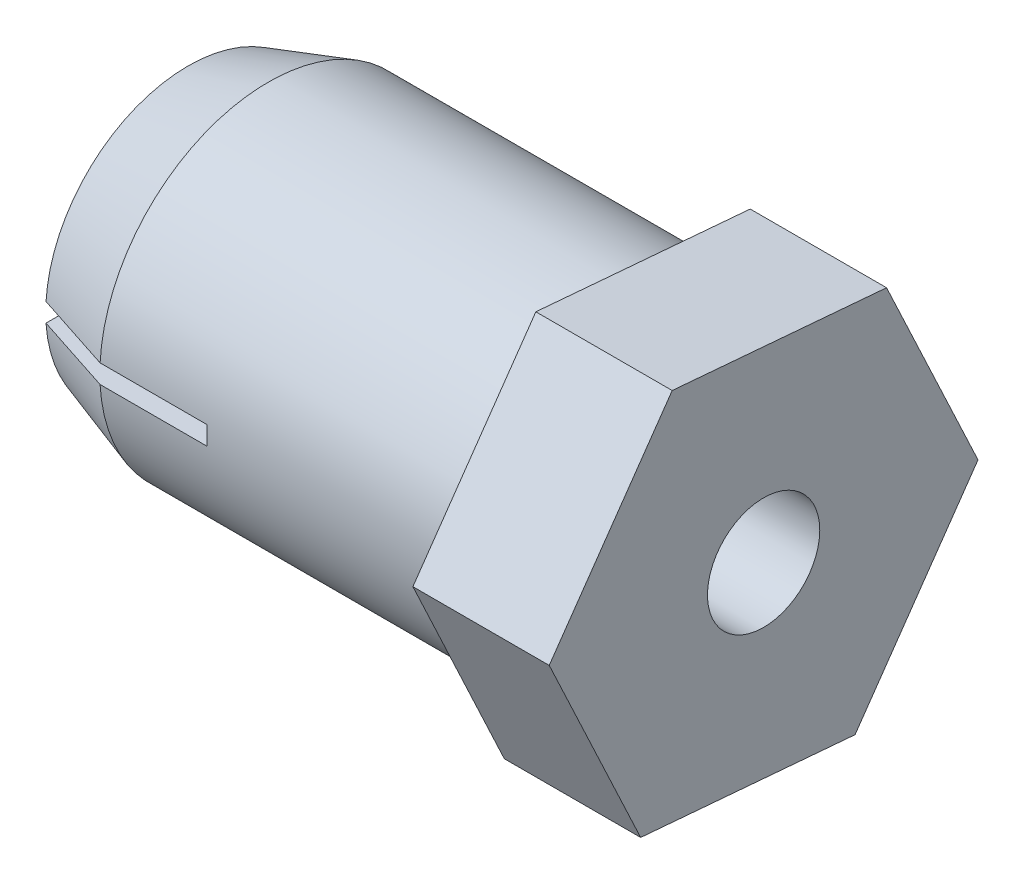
ISO-10303-21;
HEADER;
FILE_DESCRIPTION(('STEP AP214'),'2;1');
FILE_NAME('part.step','',(''),(''),'','','');
FILE_SCHEMA(('AUTOMOTIVE_DESIGN { 1 0 10303 214 1 1 1 1 }'));
ENDSEC;
DATA;
#1=APPLICATION_CONTEXT('core data for automotive mechanical design processes');
#2=APPLICATION_PROTOCOL_DEFINITION('international standard','automotive_design',2000,#1);
#3=PRODUCT_CONTEXT('',#1,'mechanical');
#4=PRODUCT('Part','Part','',(#3));
#5=PRODUCT_RELATED_PRODUCT_CATEGORY('part','',(#4));
#6=PRODUCT_DEFINITION_FORMATION('','',#4);
#7=PRODUCT_DEFINITION_CONTEXT('part definition',#1,'design');
#8=PRODUCT_DEFINITION('design','',#6,#7);
#9=PRODUCT_DEFINITION_SHAPE('','',#8);
#10=(LENGTH_UNIT() NAMED_UNIT(*) SI_UNIT(.MILLI.,.METRE.));
#11=(NAMED_UNIT(*) PLANE_ANGLE_UNIT() SI_UNIT($,.RADIAN.));
#12=(NAMED_UNIT(*) SI_UNIT($,.STERADIAN.) SOLID_ANGLE_UNIT());
#13=UNCERTAINTY_MEASURE_WITH_UNIT(LENGTH_MEASURE(1.E-05),#10,'distance_accuracy_value','');
#14=(GEOMETRIC_REPRESENTATION_CONTEXT(3) GLOBAL_UNCERTAINTY_ASSIGNED_CONTEXT((#13)) GLOBAL_UNIT_ASSIGNED_CONTEXT((#10,
#11,#12)) REPRESENTATION_CONTEXT('',''));
#15=CARTESIAN_POINT('',(0.,0.,0.));
#16=DIRECTION('',(0.,0.,1.));
#17=DIRECTION('',(1.,0.,0.));
#18=AXIS2_PLACEMENT_3D('',#15,#16,#17);
#19=CARTESIAN_POINT('',(-13.43,0.,0.));
#20=DIRECTION('',(1.,0.,0.));
#21=DIRECTION('',(0.,0.,-1.));
#22=AXIS2_PLACEMENT_3D('',#19,#20,#21);
#23=CONICAL_SURFACE('',#22,6.3,0.314231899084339);
#24=CARTESIAN_POINT('',(-23.5400334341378,0.349999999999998,-2.99384995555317));
#25=CARTESIAN_POINT('',(-22.8105636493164,0.349999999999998,-3.23250725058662));
#26=CARTESIAN_POINT('',(-22.0810028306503,0.349999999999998,-3.47088592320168));
#27=CARTESIAN_POINT('',(-20.6217571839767,0.349999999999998,-3.94726316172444));
#28=CARTESIAN_POINT('',(-19.8920723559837,0.349999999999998,-4.18526172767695));
#29=CARTESIAN_POINT('',(-18.5098872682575,0.349999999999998,-4.63587126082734));
#30=CARTESIAN_POINT('',(-17.8573936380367,0.349999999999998,-4.84850257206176));
#31=CARTESIAN_POINT('',(-16.5523685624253,0.349999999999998,-5.27364924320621));
#32=CARTESIAN_POINT('',(-15.8998371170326,0.349999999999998,-5.48616460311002));
#33=CARTESIAN_POINT('',(-13.8649457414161,0.349999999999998,-6.14875251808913));
#34=CARTESIAN_POINT('',(-12.4825423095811,0.349999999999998,-6.59869145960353));
#35=CARTESIAN_POINT('',(-9.71767094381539,0.349999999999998,-7.49837042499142));
#36=CARTESIAN_POINT('',(-8.33520300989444,0.349999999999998,-7.94811044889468));
#37=CARTESIAN_POINT('',(-6.95272634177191,0.349999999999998,-8.39782354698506));
#38=B_SPLINE_CURVE_WITH_KNOTS('',3,(#24,#25,#26,#27,#28,#29,#30,#31,#32,#33,#34,#35,#36,#37),
.UNSPECIFIED.,.F.,.F.,(4,2,2,2,2,2,4),(0.,2.30255298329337,4.60510569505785,6.66390148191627,
8.722697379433,13.0840456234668,17.4453932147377),.UNSPECIFIED.);
#39=CARTESIAN_POINT('',(-16.43,0.349999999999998,-5.31348520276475));
#40=VERTEX_POINT('',#39);
#41=CARTESIAN_POINT('',(-13.43,0.349999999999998,-6.290270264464));
#42=VERTEX_POINT('',#41);
#43=EDGE_CURVE('E204',#40,#42,#38,.T.);
#44=ORIENTED_EDGE('',*,*,#43,.F.);
#45=CARTESIAN_POINT('',(-16.43,0.,0.));
#46=DIRECTION('',(1.,0.,0.));
#47=DIRECTION('',(0.,0.,-1.));
#48=AXIS2_PLACEMENT_3D('',#45,#46,#47);
#49=CIRCLE('',#48,5.325);
#50=CARTESIAN_POINT('',(-16.43,0.349999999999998,5.31348520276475));
#51=VERTEX_POINT('',#50);
#52=EDGE_CURVE('E267',#40,#51,#49,.T.);
#53=ORIENTED_EDGE('',*,*,#52,.T.);
#54=CARTESIAN_POINT('',(-6.95272634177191,0.349999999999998,8.39782354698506));
#55=CARTESIAN_POINT('',(-8.33520317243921,0.349999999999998,7.94811032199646));
#56=CARTESIAN_POINT('',(-9.71767130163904,0.349999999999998,7.49837027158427));
#57=CARTESIAN_POINT('',(-12.4825426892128,0.349999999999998,6.59869137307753));
#58=CARTESIAN_POINT('',(-13.8649459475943,0.349999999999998,6.14875252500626));
#59=CARTESIAN_POINT('',(-15.9384669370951,0.349999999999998,5.47358617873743));
#60=CARTESIAN_POINT('',(-16.6296266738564,0.349999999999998,5.24848769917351));
#61=CARTESIAN_POINT('',(-18.0119030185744,0.349999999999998,4.7981584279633));
#62=CARTESIAN_POINT('',(-18.7030196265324,0.349999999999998,4.57292763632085));
#63=CARTESIAN_POINT('',(-20.085190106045,0.349999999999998,4.12227324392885));
#64=CARTESIAN_POINT('',(-20.7762439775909,0.349999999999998,3.89684964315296));
#65=CARTESIAN_POINT('',(-22.1582373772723,0.349999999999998,3.44565201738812));
#66=CARTESIAN_POINT('',(-22.8491769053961,0.349999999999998,3.21987799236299));
#67=CARTESIAN_POINT('',(-23.5400334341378,0.349999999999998,2.99384995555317));
#68=B_SPLINE_CURVE_WITH_KNOTS('',3,(#54,#55,#56,#57,#58,#59,#60,#61,#62,#63,#64,#65,#66,#67),
.UNSPECIFIED.,.F.,.F.,(4,2,2,2,2,2,4),(0.,4.36134817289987,8.72269583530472,10.9033700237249,
13.0840441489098,15.2647185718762,17.4453932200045),.UNSPECIFIED.);
#69=CARTESIAN_POINT('',(-13.43,0.349999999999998,6.290270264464));
#70=VERTEX_POINT('',#69);
#71=EDGE_CURVE('E185',#70,#51,#68,.T.);
#72=ORIENTED_EDGE('',*,*,#71,.F.);
#73=CARTESIAN_POINT('',(-13.43,0.,0.));
#74=DIRECTION('',(1.,0.,0.));
#75=DIRECTION('',(0.,0.,-1.));
#76=AXIS2_PLACEMENT_3D('',#73,#74,#75);
#77=CIRCLE('',#76,6.3);
#78=EDGE_CURVE('E270',#42,#70,#77,.T.);
#79=ORIENTED_EDGE('',*,*,#78,.F.);
#80=EDGE_LOOP('',(#44,#53,#72,#79));
#81=FACE_BOUND('',#80,.T.);
#82=ADVANCED_FACE('F38',(#81),#23,.T.);
#83=CARTESIAN_POINT('',(-16.43,5.325,0.));
#84=DIRECTION('',(-1.,0.,0.));
#85=DIRECTION('',(0.,0.,1.));
#86=AXIS2_PLACEMENT_3D('',#83,#84,#85);
#87=PLANE('',#86);
#88=DIRECTION('',(0.,0.,1.));
#89=VECTOR('',#88,1.);
#90=CARTESIAN_POINT('',(-16.43,0.349999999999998,-8.01942573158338));
#91=LINE('',#90,#89);
#92=CARTESIAN_POINT('',(-16.43,0.349999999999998,4.23556371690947));
#93=VERTEX_POINT('',#92);
#94=EDGE_CURVE('E297',#93,#51,#91,.T.);
#95=ORIENTED_EDGE('',*,*,#94,.T.);
#96=ORIENTED_EDGE('',*,*,#52,.F.);
#97=CARTESIAN_POINT('',(-16.43,0.349999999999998,-4.23556371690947));
#98=VERTEX_POINT('',#97);
#99=EDGE_CURVE('E306',#40,#98,#91,.T.);
#100=ORIENTED_EDGE('',*,*,#99,.T.);
#101=CARTESIAN_POINT('',(-16.43,0.,0.));
#102=DIRECTION('',(-1.,0.,0.));
#103=DIRECTION('',(0.,0.,1.));
#104=AXIS2_PLACEMENT_3D('',#101,#102,#103);
#105=CIRCLE('',#104,4.24999999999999);
#106=EDGE_CURVE('E215',#93,#98,#105,.T.);
#107=ORIENTED_EDGE('',*,*,#106,.F.);
#108=EDGE_LOOP('',(#95,#96,#100,#107));
#109=FACE_BOUND('',#108,.T.);
#110=ADVANCED_FACE('F357',(#109),#87,.T.);
#111=CARTESIAN_POINT('',(0.,0.,0.));
#112=DIRECTION('',(1.,0.,0.));
#113=DIRECTION('',(0.,0.,-1.));
#114=AXIS2_PLACEMENT_3D('',#111,#112,#113);
#115=CYLINDRICAL_SURFACE('',#114,6.3);
#116=DIRECTION('',(1.,0.,0.));
#117=VECTOR('',#116,1.);
#118=CARTESIAN_POINT('',(0.,0.349999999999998,-6.290270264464));
#119=LINE('',#118,#117);
#120=CARTESIAN_POINT('',(-9.43,0.349999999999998,-6.290270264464));
#121=VERTEX_POINT('',#120);
#122=EDGE_CURVE('E209',#42,#121,#119,.T.);
#123=ORIENTED_EDGE('',*,*,#122,.F.);
#124=ORIENTED_EDGE('',*,*,#78,.T.);
#125=DIRECTION('',(1.,0.,0.));
#126=VECTOR('',#125,1.);
#127=CARTESIAN_POINT('',(0.,0.349999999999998,6.290270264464));
#128=LINE('',#127,#126);
#129=CARTESIAN_POINT('',(-9.43,0.349999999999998,6.290270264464));
#130=VERTEX_POINT('',#129);
#131=EDGE_CURVE('E191',#130,#70,#128,.F.);
#132=ORIENTED_EDGE('',*,*,#131,.F.);
#133=CARTESIAN_POINT('',(-9.43,0.,0.));
#134=DIRECTION('',(1.,0.,0.));
#135=DIRECTION('',(0.,0.,-1.));
#136=AXIS2_PLACEMENT_3D('',#133,#134,#135);
#137=CIRCLE('',#136,6.3);
#138=CARTESIAN_POINT('',(-9.43,-0.350000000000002,6.290270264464));
#139=VERTEX_POINT('',#138);
#140=EDGE_CURVE('E162',#139,#130,#137,.F.);
#141=ORIENTED_EDGE('',*,*,#140,.F.);
#142=DIRECTION('',(1.,0.,0.));
#143=VECTOR('',#142,1.);
#144=CARTESIAN_POINT('',(0.,-0.350000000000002,6.290270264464));
#145=LINE('',#144,#143);
#146=CARTESIAN_POINT('',(-13.43,-0.350000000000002,6.290270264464));
#147=VERTEX_POINT('',#146);
#148=EDGE_CURVE('E177',#147,#139,#145,.T.);
#149=ORIENTED_EDGE('',*,*,#148,.F.);
#150=CARTESIAN_POINT('',(-13.43,-0.350000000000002,-6.290270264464));
#151=VERTEX_POINT('',#150);
#152=EDGE_CURVE('E174',#147,#151,#77,.T.);
#153=ORIENTED_EDGE('',*,*,#152,.T.);
#154=DIRECTION('',(1.,0.,0.));
#155=VECTOR('',#154,1.);
#156=CARTESIAN_POINT('',(0.,-0.350000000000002,-6.290270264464));
#157=LINE('',#156,#155);
#158=CARTESIAN_POINT('',(-9.43,-0.350000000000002,-6.290270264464));
#159=VERTEX_POINT('',#158);
#160=EDGE_CURVE('E163',#159,#151,#157,.F.);
#161=ORIENTED_EDGE('',*,*,#160,.F.);
#162=EDGE_CURVE('E152',#121,#159,#137,.F.);
#163=ORIENTED_EDGE('',*,*,#162,.F.);
#164=EDGE_LOOP('',(#123,#124,#132,#141,#149,#153,#161,#163));
#165=FACE_BOUND('',#164,.T.);
#166=CARTESIAN_POINT('',(0.,0.,0.));
#167=DIRECTION('',(1.,0.,0.));
#168=DIRECTION('',(0.,0.,-1.));
#169=AXIS2_PLACEMENT_3D('',#166,#167,#168);
#170=CIRCLE('',#169,6.3);
#171=CARTESIAN_POINT('',(0.,0.,-6.3));
#172=VERTEX_POINT('',#171);
#173=EDGE_CURVE('E273',#172,#172,#170,.T.);
#174=ORIENTED_EDGE('',*,*,#173,.F.);
#175=EDGE_LOOP('',(#174));
#176=FACE_BOUND('',#175,.T.);
#177=ADVANCED_FACE('F40',(#165,#176),#115,.T.);
#178=CARTESIAN_POINT('',(-6.95272634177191,-0.350000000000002,-8.39782354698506));
#179=CARTESIAN_POINT('',(-8.33520317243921,-0.350000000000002,-7.94811032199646));
#180=CARTESIAN_POINT('',(-9.71767130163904,-0.350000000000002,-7.49837027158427));
#181=CARTESIAN_POINT('',(-12.4825426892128,-0.350000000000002,-6.59869137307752));
#182=CARTESIAN_POINT('',(-13.8649459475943,-0.350000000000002,-6.14875252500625));
#183=CARTESIAN_POINT('',(-15.9384669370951,-0.350000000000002,-5.47358617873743));
#184=CARTESIAN_POINT('',(-16.6296266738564,-0.350000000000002,-5.2484876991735));
#185=CARTESIAN_POINT('',(-18.0119030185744,-0.350000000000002,-4.7981584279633));
#186=CARTESIAN_POINT('',(-18.7030196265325,-0.350000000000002,-4.57292763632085));
#187=CARTESIAN_POINT('',(-20.085190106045,-0.350000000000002,-4.12227324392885));
#188=CARTESIAN_POINT('',(-20.7762439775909,-0.350000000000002,-3.89684964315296));
#189=CARTESIAN_POINT('',(-22.1582373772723,-0.350000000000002,-3.44565201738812));
#190=CARTESIAN_POINT('',(-22.8491769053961,-0.350000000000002,-3.21987799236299));
#191=CARTESIAN_POINT('',(-23.5400334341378,-0.350000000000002,-2.99384995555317));
#192=B_SPLINE_CURVE_WITH_KNOTS('',3,(#178,#179,#180,#181,#182,#183,#184,#185,#186,#187,#188,
#189,#190,#191),.UNSPECIFIED.,.F.,.F.,(4,2,2,2,2,2,4),(0.,4.36134817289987,8.72269583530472,
10.9033700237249,13.0840441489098,15.2647185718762,17.4453932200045),.UNSPECIFIED.);
#193=CARTESIAN_POINT('',(-16.43,-0.350000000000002,-5.31348520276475));
#194=VERTEX_POINT('',#193);
#195=EDGE_CURVE('E175',#151,#194,#192,.T.);
#196=ORIENTED_EDGE('',*,*,#195,.F.);
#197=ORIENTED_EDGE('',*,*,#152,.F.);
#198=CARTESIAN_POINT('',(-23.5400334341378,-0.350000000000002,2.99384995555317));
#199=CARTESIAN_POINT('',(-22.8105636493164,-0.350000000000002,3.23250725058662));
#200=CARTESIAN_POINT('',(-22.0810028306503,-0.350000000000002,3.47088592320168));
#201=CARTESIAN_POINT('',(-20.6217571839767,-0.350000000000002,3.94726316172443));
#202=CARTESIAN_POINT('',(-19.8920723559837,-0.350000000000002,4.18526172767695));
#203=CARTESIAN_POINT('',(-18.5098872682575,-0.350000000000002,4.63587126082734));
#204=CARTESIAN_POINT('',(-17.8573936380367,-0.350000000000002,4.84850257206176));
#205=CARTESIAN_POINT('',(-16.5523685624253,-0.350000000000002,5.27364924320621));
#206=CARTESIAN_POINT('',(-15.8998371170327,-0.350000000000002,5.48616460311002));
#207=CARTESIAN_POINT('',(-13.8649457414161,-0.350000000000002,6.14875251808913));
#208=CARTESIAN_POINT('',(-12.4825423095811,-0.350000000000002,6.59869145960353));
#209=CARTESIAN_POINT('',(-9.71767094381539,-0.350000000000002,7.49837042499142));
#210=CARTESIAN_POINT('',(-8.33520300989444,-0.350000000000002,7.94811044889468));
#211=CARTESIAN_POINT('',(-6.95272634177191,-0.350000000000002,8.39782354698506));
#212=B_SPLINE_CURVE_WITH_KNOTS('',3,(#198,#199,#200,#201,#202,#203,#204,#205,#206,#207,#208,
#209,#210,#211),.UNSPECIFIED.,.F.,.F.,(4,2,2,2,2,2,4),(0.,2.30255298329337,4.60510569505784,
6.66390148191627,8.72269737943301,13.0840456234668,17.4453932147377),.UNSPECIFIED.);
#213=CARTESIAN_POINT('',(-16.43,-0.350000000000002,5.31348520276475));
#214=VERTEX_POINT('',#213);
#215=EDGE_CURVE('E302',#214,#147,#212,.T.);
#216=ORIENTED_EDGE('',*,*,#215,.F.);
#217=EDGE_CURVE('E266',#214,#194,#49,.T.);
#218=ORIENTED_EDGE('',*,*,#217,.T.);
#219=EDGE_LOOP('',(#196,#197,#216,#218));
#220=FACE_BOUND('',#219,.T.);
#221=ADVANCED_FACE('F193',(#220),#23,.T.);
#222=DIRECTION('',(0.,0.,1.));
#223=VECTOR('',#222,1.);
#224=CARTESIAN_POINT('',(-16.43,-0.350000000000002,-8.01942573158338));
#225=LINE('',#224,#223);
#226=CARTESIAN_POINT('',(-16.43,-0.350000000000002,-4.23556371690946));
#227=VERTEX_POINT('',#226);
#228=EDGE_CURVE('E61',#194,#227,#225,.T.);
#229=ORIENTED_EDGE('',*,*,#228,.F.);
#230=ORIENTED_EDGE('',*,*,#217,.F.);
#231=CARTESIAN_POINT('',(-16.43,-0.350000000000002,4.23556371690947));
#232=VERTEX_POINT('',#231);
#233=EDGE_CURVE('E300',#232,#214,#225,.T.);
#234=ORIENTED_EDGE('',*,*,#233,.F.);
#235=EDGE_CURVE('E219',#227,#232,#105,.T.);
#236=ORIENTED_EDGE('',*,*,#235,.F.);
#237=EDGE_LOOP('',(#229,#230,#234,#236));
#238=FACE_BOUND('',#237,.T.);
#239=ADVANCED_FACE('F353',(#238),#87,.T.);
#240=CARTESIAN_POINT('',(5.1,-7.28537338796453,-3.42021460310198));
#241=DIRECTION('',(0.,0.571453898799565,0.820634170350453));
#242=DIRECTION('',(0.,-0.820634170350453,0.571453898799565));
#243=AXIS2_PLACEMENT_3D('',#240,#241,#242);
#244=PLANE('',#243);
#245=DIRECTION('',(0.,0.820634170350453,-0.571453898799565));
#246=VECTOR('',#245,1.);
#247=CARTESIAN_POINT('',(0.,-7.28537338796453,-3.42021460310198));
#248=LINE('',#247,#246);
#249=CARTESIAN_POINT('',(0.,-7.28537338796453,-3.42021460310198));
#250=VERTEX_POINT('',#249);
#251=CARTESIAN_POINT('',(0.,-0.680693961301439,-8.01942573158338));
#252=VERTEX_POINT('',#251);
#253=EDGE_CURVE('E222',#250,#252,#248,.T.);
#254=ORIENTED_EDGE('',*,*,#253,.T.);
#255=DIRECTION('',(-1.,0.,0.));
#256=VECTOR('',#255,1.);
#257=CARTESIAN_POINT('',(5.1,-0.680693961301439,-8.01942573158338));
#258=LINE('',#257,#256);
#259=CARTESIAN_POINT('',(5.1,-0.680693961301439,-8.01942573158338));
#260=VERTEX_POINT('',#259);
#261=EDGE_CURVE('E263',#260,#252,#258,.T.);
#262=ORIENTED_EDGE('',*,*,#261,.F.);
#263=DIRECTION('',(0.,0.820634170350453,-0.571453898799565));
#264=VECTOR('',#263,1.);
#265=CARTESIAN_POINT('',(5.1,-7.28537338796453,-3.42021460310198));
#266=LINE('',#265,#264);
#267=CARTESIAN_POINT('',(5.1,-7.28537338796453,-3.42021460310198));
#268=VERTEX_POINT('',#267);
#269=EDGE_CURVE('E223',#268,#260,#266,.T.);
#270=ORIENTED_EDGE('',*,*,#269,.F.);
#271=DIRECTION('',(-1.,0.,0.));
#272=VECTOR('',#271,1.);
#273=CARTESIAN_POINT('',(5.1,-7.28537338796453,-3.42021460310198));
#274=LINE('',#273,#272);
#275=EDGE_CURVE('E237',#268,#250,#274,.T.);
#276=ORIENTED_EDGE('',*,*,#275,.T.);
#277=EDGE_LOOP('',(#254,#262,#270,#276));
#278=FACE_BOUND('',#277,.T.);
#279=ADVANCED_FACE('F350',(#278),#244,.F.);
#280=CARTESIAN_POINT('',(5.1,-0.680693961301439,-8.01942573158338));
#281=DIRECTION('',(0.,-0.424963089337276,0.905210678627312));
#282=DIRECTION('',(0.,-0.905210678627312,-0.424963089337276));
#283=AXIS2_PLACEMENT_3D('',#280,#281,#282);
#284=PLANE('',#283);
#285=DIRECTION('',(0.,0.905210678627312,0.424963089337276));
#286=VECTOR('',#285,1.);
#287=CARTESIAN_POINT('',(0.,-0.680693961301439,-8.01942573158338));
#288=LINE('',#287,#286);
#289=CARTESIAN_POINT('',(0.,6.60467942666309,-4.5992111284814));
#290=VERTEX_POINT('',#289);
#291=EDGE_CURVE('E240',#252,#290,#288,.T.);
#292=ORIENTED_EDGE('',*,*,#291,.T.);
#293=DIRECTION('',(-1.,0.,0.));
#294=VECTOR('',#293,1.);
#295=CARTESIAN_POINT('',(5.1,6.60467942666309,-4.5992111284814));
#296=LINE('',#295,#294);
#297=CARTESIAN_POINT('',(5.1,6.60467942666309,-4.5992111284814));
#298=VERTEX_POINT('',#297);
#299=EDGE_CURVE('E260',#298,#290,#296,.T.);
#300=ORIENTED_EDGE('',*,*,#299,.F.);
#301=DIRECTION('',(0.,0.905210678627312,0.424963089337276));
#302=VECTOR('',#301,1.);
#303=CARTESIAN_POINT('',(5.1,-0.680693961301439,-8.01942573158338));
#304=LINE('',#303,#302);
#305=EDGE_CURVE('E226',#260,#298,#304,.T.);
#306=ORIENTED_EDGE('',*,*,#305,.F.);
#307=ORIENTED_EDGE('',*,*,#261,.T.);
#308=EDGE_LOOP('',(#292,#300,#306,#307));
#309=FACE_BOUND('',#308,.T.);
#310=ADVANCED_FACE('F346',(#309),#284,.F.);
#311=CARTESIAN_POINT('',(5.1,6.60467942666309,-4.5992111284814));
#312=DIRECTION('',(0.,-0.996416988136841,0.0845765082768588));
#313=DIRECTION('',(0.,-0.0845765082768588,-0.996416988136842));
#314=AXIS2_PLACEMENT_3D('',#311,#312,#313);
#315=PLANE('',#314);
#316=DIRECTION('',(0.,0.0845765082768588,0.996416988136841));
#317=VECTOR('',#316,1.);
#318=CARTESIAN_POINT('',(0.,6.60467942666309,-4.5992111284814));
#319=LINE('',#318,#317);
#320=CARTESIAN_POINT('',(0.,7.28537338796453,3.42021460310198));
#321=VERTEX_POINT('',#320);
#322=EDGE_CURVE('E242',#290,#321,#319,.T.);
#323=ORIENTED_EDGE('',*,*,#322,.T.);
#324=DIRECTION('',(-1.,0.,0.));
#325=VECTOR('',#324,1.);
#326=CARTESIAN_POINT('',(5.1,7.28537338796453,3.42021460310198));
#327=LINE('',#326,#325);
#328=CARTESIAN_POINT('',(5.1,7.28537338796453,3.42021460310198));
#329=VERTEX_POINT('',#328);
#330=EDGE_CURVE('E257',#329,#321,#327,.T.);
#331=ORIENTED_EDGE('',*,*,#330,.F.);
#332=DIRECTION('',(0.,0.0845765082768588,0.996416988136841));
#333=VECTOR('',#332,1.);
#334=CARTESIAN_POINT('',(5.1,6.60467942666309,-4.5992111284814));
#335=LINE('',#334,#333);
#336=EDGE_CURVE('E229',#298,#329,#335,.T.);
#337=ORIENTED_EDGE('',*,*,#336,.F.);
#338=ORIENTED_EDGE('',*,*,#299,.T.);
#339=EDGE_LOOP('',(#323,#331,#337,#338));
#340=FACE_BOUND('',#339,.T.);
#341=ADVANCED_FACE('F342',(#340),#315,.F.);
#342=CARTESIAN_POINT('',(5.1,7.28537338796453,3.42021460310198));
#343=DIRECTION('',(0.,-0.571453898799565,-0.820634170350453));
#344=DIRECTION('',(0.,0.820634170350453,-0.571453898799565));
#345=AXIS2_PLACEMENT_3D('',#342,#343,#344);
#346=PLANE('',#345);
#347=DIRECTION('',(0.,-0.820634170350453,0.571453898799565));
#348=VECTOR('',#347,1.);
#349=CARTESIAN_POINT('',(0.,7.28537338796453,3.42021460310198));
#350=LINE('',#349,#348);
#351=CARTESIAN_POINT('',(0.,0.680693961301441,8.01942573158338));
#352=VERTEX_POINT('',#351);
#353=EDGE_CURVE('E244',#321,#352,#350,.T.);
#354=ORIENTED_EDGE('',*,*,#353,.T.);
#355=DIRECTION('',(-1.,0.,0.));
#356=VECTOR('',#355,1.);
#357=CARTESIAN_POINT('',(5.1,0.680693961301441,8.01942573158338));
#358=LINE('',#357,#356);
#359=CARTESIAN_POINT('',(5.1,0.680693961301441,8.01942573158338));
#360=VERTEX_POINT('',#359);
#361=EDGE_CURVE('E254',#360,#352,#358,.T.);
#362=ORIENTED_EDGE('',*,*,#361,.F.);
#363=DIRECTION('',(0.,-0.820634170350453,0.571453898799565));
#364=VECTOR('',#363,1.);
#365=CARTESIAN_POINT('',(5.1,7.28537338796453,3.42021460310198));
#366=LINE('',#365,#364);
#367=EDGE_CURVE('E231',#329,#360,#366,.T.);
#368=ORIENTED_EDGE('',*,*,#367,.F.);
#369=ORIENTED_EDGE('',*,*,#330,.T.);
#370=EDGE_LOOP('',(#354,#362,#368,#369));
#371=FACE_BOUND('',#370,.T.);
#372=ADVANCED_FACE('F338',(#371),#346,.F.);
#373=CARTESIAN_POINT('',(5.1,0.680693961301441,8.01942573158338));
#374=DIRECTION('',(0.,0.424963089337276,-0.905210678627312));
#375=DIRECTION('',(0.,0.905210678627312,0.424963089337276));
#376=AXIS2_PLACEMENT_3D('',#373,#374,#375);
#377=PLANE('',#376);
#378=DIRECTION('',(0.,-0.905210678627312,-0.424963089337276));
#379=VECTOR('',#378,1.);
#380=CARTESIAN_POINT('',(0.,0.680693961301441,8.01942573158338));
#381=LINE('',#380,#379);
#382=CARTESIAN_POINT('',(0.,-6.60467942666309,4.5992111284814));
#383=VERTEX_POINT('',#382);
#384=EDGE_CURVE('E246',#352,#383,#381,.T.);
#385=ORIENTED_EDGE('',*,*,#384,.T.);
#386=DIRECTION('',(-1.,0.,0.));
#387=VECTOR('',#386,1.);
#388=CARTESIAN_POINT('',(5.1,-6.60467942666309,4.5992111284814));
#389=LINE('',#388,#387);
#390=CARTESIAN_POINT('',(5.1,-6.60467942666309,4.5992111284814));
#391=VERTEX_POINT('',#390);
#392=EDGE_CURVE('E251',#391,#383,#389,.T.);
#393=ORIENTED_EDGE('',*,*,#392,.F.);
#394=DIRECTION('',(0.,-0.905210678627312,-0.424963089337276));
#395=VECTOR('',#394,1.);
#396=CARTESIAN_POINT('',(5.1,0.680693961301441,8.01942573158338));
#397=LINE('',#396,#395);
#398=EDGE_CURVE('E233',#360,#391,#397,.T.);
#399=ORIENTED_EDGE('',*,*,#398,.F.);
#400=ORIENTED_EDGE('',*,*,#361,.T.);
#401=EDGE_LOOP('',(#385,#393,#399,#400));
#402=FACE_BOUND('',#401,.T.);
#403=ADVANCED_FACE('F334',(#402),#377,.F.);
#404=CARTESIAN_POINT('',(5.1,-6.60467942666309,4.5992111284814));
#405=DIRECTION('',(0.,0.996416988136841,-0.0845765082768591));
#406=DIRECTION('',(0.,0.0845765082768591,0.996416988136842));
#407=AXIS2_PLACEMENT_3D('',#404,#405,#406);
#408=PLANE('',#407);
#409=DIRECTION('',(0.,-0.0845765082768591,-0.996416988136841));
#410=VECTOR('',#409,1.);
#411=CARTESIAN_POINT('',(0.,-6.60467942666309,4.5992111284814));
#412=LINE('',#411,#410);
#413=EDGE_CURVE('E227',#383,#250,#412,.T.);
#414=ORIENTED_EDGE('',*,*,#413,.T.);
#415=ORIENTED_EDGE('',*,*,#275,.F.);
#416=DIRECTION('',(0.,-0.0845765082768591,-0.996416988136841));
#417=VECTOR('',#416,1.);
#418=CARTESIAN_POINT('',(5.1,-6.60467942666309,4.5992111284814));
#419=LINE('',#418,#417);
#420=EDGE_CURVE('E235',#391,#268,#419,.T.);
#421=ORIENTED_EDGE('',*,*,#420,.F.);
#422=ORIENTED_EDGE('',*,*,#392,.T.);
#423=EDGE_LOOP('',(#414,#415,#421,#422));
#424=FACE_BOUND('',#423,.T.);
#425=ADVANCED_FACE('F327',(#424),#408,.F.);
#426=CARTESIAN_POINT('',(5.1,-0.680693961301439,-8.01942573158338));
#427=DIRECTION('',(1.,0.,0.));
#428=DIRECTION('',(0.,0.,-1.));
#429=AXIS2_PLACEMENT_3D('',#426,#427,#428);
#430=PLANE('',#429);
#431=CARTESIAN_POINT('',(5.1,0.,0.));
#432=DIRECTION('',(1.,0.,0.));
#433=DIRECTION('',(0.,0.,-1.));
#434=AXIS2_PLACEMENT_3D('',#431,#432,#433);
#435=CIRCLE('',#434,2.09999999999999);
#436=CARTESIAN_POINT('',(5.1,0.,-2.09999999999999));
#437=VERTEX_POINT('',#436);
#438=EDGE_CURVE('E211',#437,#437,#435,.T.);
#439=ORIENTED_EDGE('',*,*,#438,.F.);
#440=EDGE_LOOP('',(#439));
#441=FACE_BOUND('',#440,.T.);
#442=ORIENTED_EDGE('',*,*,#269,.T.);
#443=ORIENTED_EDGE('',*,*,#305,.T.);
#444=ORIENTED_EDGE('',*,*,#336,.T.);
#445=ORIENTED_EDGE('',*,*,#367,.T.);
#446=ORIENTED_EDGE('',*,*,#398,.T.);
#447=ORIENTED_EDGE('',*,*,#420,.T.);
#448=EDGE_LOOP('',(#442,#443,#444,#445,#446,#447));
#449=FACE_BOUND('',#448,.T.);
#450=ADVANCED_FACE('F324',(#441,#449),#430,.T.);
#451=CARTESIAN_POINT('',(0.,-0.680693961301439,-8.01942573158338));
#452=DIRECTION('',(1.,0.,0.));
#453=DIRECTION('',(0.,0.,-1.));
#454=AXIS2_PLACEMENT_3D('',#451,#452,#453);
#455=PLANE('',#454);
#456=ORIENTED_EDGE('',*,*,#173,.T.);
#457=EDGE_LOOP('',(#456));
#458=FACE_BOUND('',#457,.T.);
#459=ORIENTED_EDGE('',*,*,#253,.F.);
#460=ORIENTED_EDGE('',*,*,#413,.F.);
#461=ORIENTED_EDGE('',*,*,#384,.F.);
#462=ORIENTED_EDGE('',*,*,#353,.F.);
#463=ORIENTED_EDGE('',*,*,#322,.F.);
#464=ORIENTED_EDGE('',*,*,#291,.F.);
#465=EDGE_LOOP('',(#459,#460,#461,#462,#463,#464));
#466=FACE_BOUND('',#465,.T.);
#467=ADVANCED_FACE('F322',(#458,#466),#455,.F.);
#468=CARTESIAN_POINT('',(0.0700000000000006,0.,0.));
#469=DIRECTION('',(-1.,0.,0.));
#470=DIRECTION('',(0.,0.,1.));
#471=AXIS2_PLACEMENT_3D('',#468,#469,#470);
#472=CONICAL_SURFACE('',#471,4.25,1.02974425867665);
#473=CARTESIAN_POINT('',(1.36185033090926,0.,0.));
#474=DIRECTION('',(-1.,0.,0.));
#475=DIRECTION('',(0.,0.,1.));
#476=AXIS2_PLACEMENT_3D('',#473,#474,#475);
#477=CIRCLE('',#476,2.09999999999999);
#478=CARTESIAN_POINT('',(1.36185033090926,0.,2.09999999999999));
#479=VERTEX_POINT('',#478);
#480=EDGE_CURVE('E214',#479,#479,#477,.F.);
#481=ORIENTED_EDGE('',*,*,#480,.T.);
#482=EDGE_LOOP('',(#481));
#483=FACE_BOUND('',#482,.T.);
#484=CARTESIAN_POINT('',(0.0700000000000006,0.,0.));
#485=DIRECTION('',(-1.,0.,0.));
#486=DIRECTION('',(0.,0.,1.));
#487=AXIS2_PLACEMENT_3D('',#484,#485,#486);
#488=CIRCLE('',#487,4.25);
#489=CARTESIAN_POINT('',(0.0700000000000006,0.,4.25));
#490=VERTEX_POINT('',#489);
#491=EDGE_CURVE('E218',#490,#490,#488,.T.);
#492=ORIENTED_EDGE('',*,*,#491,.T.);
#493=EDGE_LOOP('',(#492));
#494=FACE_BOUND('',#493,.T.);
#495=ADVANCED_FACE('F318',(#483,#494),#472,.F.);
#496=CARTESIAN_POINT('',(-16.43,0.,0.));
#497=DIRECTION('',(-1.,0.,0.));
#498=DIRECTION('',(0.,0.,1.));
#499=AXIS2_PLACEMENT_3D('',#496,#497,#498);
#500=CYLINDRICAL_SURFACE('',#499,4.24999999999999);
#501=ORIENTED_EDGE('',*,*,#491,.F.);
#502=EDGE_LOOP('',(#501));
#503=FACE_BOUND('',#502,.T.);
#504=CARTESIAN_POINT('',(-9.43,0.,0.));
#505=DIRECTION('',(1.,0.,0.));
#506=DIRECTION('',(0.,0.,-1.));
#507=AXIS2_PLACEMENT_3D('',#504,#505,#506);
#508=CIRCLE('',#507,4.24999999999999);
#509=CARTESIAN_POINT('',(-9.43,-0.350000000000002,4.23556371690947));
#510=VERTEX_POINT('',#509);
#511=CARTESIAN_POINT('',(-9.43,0.349999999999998,4.23556371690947));
#512=VERTEX_POINT('',#511);
#513=EDGE_CURVE('E46',#510,#512,#508,.F.);
#514=ORIENTED_EDGE('',*,*,#513,.T.);
#515=DIRECTION('',(-1.,0.,0.));
#516=VECTOR('',#515,1.);
#517=CARTESIAN_POINT('',(-16.43,0.349999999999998,4.23556371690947));
#518=LINE('',#517,#516);
#519=EDGE_CURVE('E11',#512,#93,#518,.T.);
#520=ORIENTED_EDGE('',*,*,#519,.T.);
#521=ORIENTED_EDGE('',*,*,#106,.T.);
#522=DIRECTION('',(-1.,0.,0.));
#523=VECTOR('',#522,1.);
#524=CARTESIAN_POINT('',(-16.43,0.349999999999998,-4.23556371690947));
#525=LINE('',#524,#523);
#526=CARTESIAN_POINT('',(-9.43,0.349999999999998,-4.23556371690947));
#527=VERTEX_POINT('',#526);
#528=EDGE_CURVE('E281',#98,#527,#525,.F.);
#529=ORIENTED_EDGE('',*,*,#528,.T.);
#530=CARTESIAN_POINT('',(-9.43,-0.350000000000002,-4.23556371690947));
#531=VERTEX_POINT('',#530);
#532=EDGE_CURVE('E279',#527,#531,#508,.F.);
#533=ORIENTED_EDGE('',*,*,#532,.T.);
#534=DIRECTION('',(-1.,0.,0.));
#535=VECTOR('',#534,1.);
#536=CARTESIAN_POINT('',(-16.43,-0.350000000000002,-4.23556371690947));
#537=LINE('',#536,#535);
#538=EDGE_CURVE('E167',#531,#227,#537,.T.);
#539=ORIENTED_EDGE('',*,*,#538,.T.);
#540=ORIENTED_EDGE('',*,*,#235,.T.);
#541=DIRECTION('',(-1.,0.,0.));
#542=VECTOR('',#541,1.);
#543=CARTESIAN_POINT('',(-16.43,-0.350000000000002,4.23556371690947));
#544=LINE('',#543,#542);
#545=EDGE_CURVE('E283',#232,#510,#544,.F.);
#546=ORIENTED_EDGE('',*,*,#545,.T.);
#547=EDGE_LOOP('',(#514,#520,#521,#529,#533,#539,#540,#546));
#548=FACE_BOUND('',#547,.T.);
#549=ADVANCED_FACE('F288',(#503,#548),#500,.F.);
#550=CARTESIAN_POINT('',(5.1,0.,0.));
#551=DIRECTION('',(1.,0.,0.));
#552=DIRECTION('',(0.,0.,-1.));
#553=AXIS2_PLACEMENT_3D('',#550,#551,#552);
#554=CYLINDRICAL_SURFACE('',#553,2.09999999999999);
#555=ORIENTED_EDGE('',*,*,#438,.T.);
#556=EDGE_LOOP('',(#555));
#557=FACE_BOUND('',#556,.T.);
#558=ORIENTED_EDGE('',*,*,#480,.F.);
#559=EDGE_LOOP('',(#558));
#560=FACE_BOUND('',#559,.T.);
#561=ADVANCED_FACE('F311',(#557,#560),#554,.F.);
#562=CARTESIAN_POINT('',(-16.43,-0.350000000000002,-8.01942573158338));
#563=DIRECTION('',(0.,-1.,0.));
#564=DIRECTION('',(0.,0.,-1.));
#565=AXIS2_PLACEMENT_3D('',#562,#563,#564);
#566=PLANE('',#565);
#567=ORIENTED_EDGE('',*,*,#160,.T.);
#568=ORIENTED_EDGE('',*,*,#195,.T.);
#569=ORIENTED_EDGE('',*,*,#228,.T.);
#570=ORIENTED_EDGE('',*,*,#538,.F.);
#571=DIRECTION('',(0.,0.,1.));
#572=VECTOR('',#571,1.);
#573=CARTESIAN_POINT('',(-9.43,-0.350000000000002,-8.01942573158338));
#574=LINE('',#573,#572);
#575=EDGE_CURVE('E155',#159,#531,#574,.T.);
#576=ORIENTED_EDGE('',*,*,#575,.F.);
#577=EDGE_LOOP('',(#567,#568,#569,#570,#576));
#578=FACE_BOUND('',#577,.T.);
#579=ADVANCED_FACE('F165',(#578),#566,.F.);
#580=CARTESIAN_POINT('',(-9.43,0.349999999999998,-8.01942573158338));
#581=DIRECTION('',(1.,0.,0.));
#582=DIRECTION('',(0.,0.,-1.));
#583=AXIS2_PLACEMENT_3D('',#580,#581,#582);
#584=PLANE('',#583);
#585=ORIENTED_EDGE('',*,*,#162,.T.);
#586=ORIENTED_EDGE('',*,*,#575,.T.);
#587=ORIENTED_EDGE('',*,*,#532,.F.);
#588=DIRECTION('',(0.,0.,1.));
#589=VECTOR('',#588,1.);
#590=CARTESIAN_POINT('',(-9.43,0.349999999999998,-8.01942573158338));
#591=LINE('',#590,#589);
#592=EDGE_CURVE('E158',#121,#527,#591,.T.);
#593=ORIENTED_EDGE('',*,*,#592,.F.);
#594=EDGE_LOOP('',(#585,#586,#587,#593));
#595=FACE_BOUND('',#594,.T.);
#596=ADVANCED_FACE('F154',(#595),#584,.F.);
#597=CARTESIAN_POINT('',(-16.43,0.349999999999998,-8.01942573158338));
#598=DIRECTION('',(0.,1.,0.));
#599=DIRECTION('',(-1.,0.,0.));
#600=AXIS2_PLACEMENT_3D('',#597,#598,#599);
#601=PLANE('',#600);
#602=ORIENTED_EDGE('',*,*,#122,.T.);
#603=ORIENTED_EDGE('',*,*,#592,.T.);
#604=ORIENTED_EDGE('',*,*,#528,.F.);
#605=ORIENTED_EDGE('',*,*,#99,.F.);
#606=ORIENTED_EDGE('',*,*,#43,.T.);
#607=EDGE_LOOP('',(#602,#603,#604,#605,#606));
#608=FACE_BOUND('',#607,.T.);
#609=ADVANCED_FACE('F196',(#608),#601,.F.);
#610=ORIENTED_EDGE('',*,*,#131,.T.);
#611=ORIENTED_EDGE('',*,*,#71,.T.);
#612=ORIENTED_EDGE('',*,*,#94,.F.);
#613=ORIENTED_EDGE('',*,*,#519,.F.);
#614=EDGE_CURVE('E168',#512,#130,#591,.T.);
#615=ORIENTED_EDGE('',*,*,#614,.T.);
#616=EDGE_LOOP('',(#610,#611,#612,#613,#615));
#617=FACE_BOUND('',#616,.T.);
#618=ADVANCED_FACE('F200',(#617),#601,.F.);
#619=ORIENTED_EDGE('',*,*,#140,.T.);
#620=ORIENTED_EDGE('',*,*,#614,.F.);
#621=ORIENTED_EDGE('',*,*,#513,.F.);
#622=EDGE_CURVE('E53',#510,#139,#574,.T.);
#623=ORIENTED_EDGE('',*,*,#622,.T.);
#624=EDGE_LOOP('',(#619,#620,#621,#623));
#625=FACE_BOUND('',#624,.T.);
#626=ADVANCED_FACE('F202',(#625),#584,.F.);
#627=ORIENTED_EDGE('',*,*,#148,.T.);
#628=ORIENTED_EDGE('',*,*,#622,.F.);
#629=ORIENTED_EDGE('',*,*,#545,.F.);
#630=ORIENTED_EDGE('',*,*,#233,.T.);
#631=ORIENTED_EDGE('',*,*,#215,.T.);
#632=EDGE_LOOP('',(#627,#628,#629,#630,#631));
#633=FACE_BOUND('',#632,.T.);
#634=ADVANCED_FACE('F307',(#633),#566,.F.);
#635=CLOSED_SHELL('',(#82,#110,#177,#221,#239,#279,#310,#341,#372,#403,#425,#450,#467,#495,#549,
#561,#579,#596,#609,#618,#626,#634));
#636=MANIFOLD_SOLID_BREP('B2',#635);
#637=ADVANCED_BREP_SHAPE_REPRESENTATION('',(#18,#636),#14);
#638=SHAPE_DEFINITION_REPRESENTATION(#9,#637);
ENDSEC;
END-ISO-10303-21;
